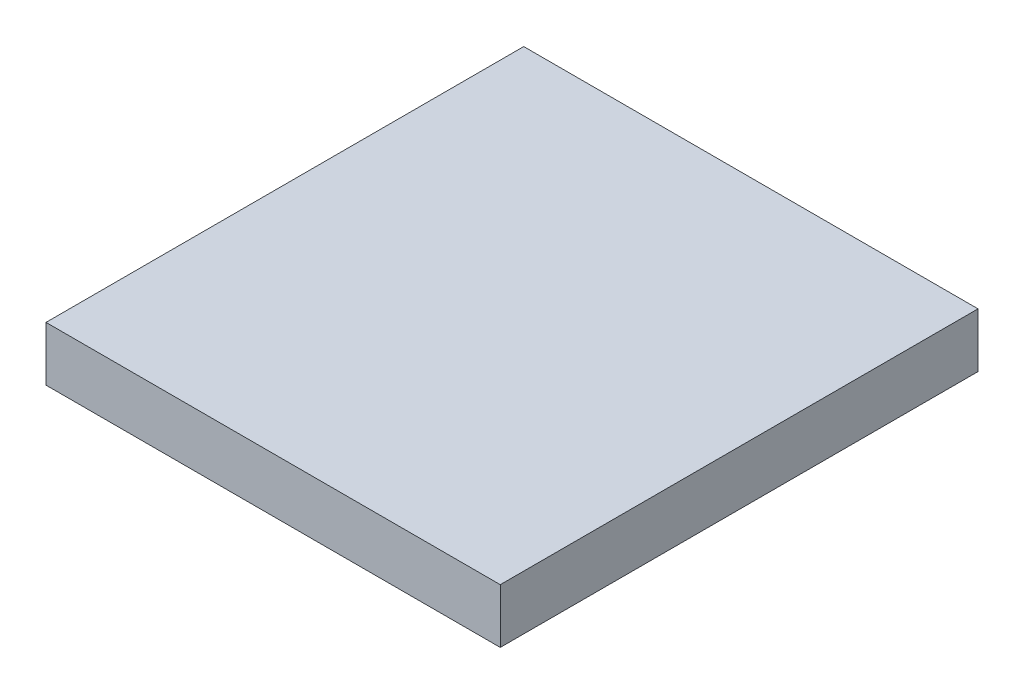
ISO-10303-21;
HEADER;
FILE_DESCRIPTION(('STEP AP214'),'2;1');
FILE_NAME('part.step','',(''),(''),'','','');
FILE_SCHEMA(('AUTOMOTIVE_DESIGN { 1 0 10303 214 1 1 1 1 }'));
ENDSEC;
DATA;
#1=APPLICATION_CONTEXT('core data for automotive mechanical design processes');
#2=APPLICATION_PROTOCOL_DEFINITION('international standard','automotive_design',2000,#1);
#3=PRODUCT_CONTEXT('',#1,'mechanical');
#4=PRODUCT('Part','Part','',(#3));
#5=PRODUCT_RELATED_PRODUCT_CATEGORY('part','',(#4));
#6=PRODUCT_DEFINITION_FORMATION('','',#4);
#7=PRODUCT_DEFINITION_CONTEXT('part definition',#1,'design');
#8=PRODUCT_DEFINITION('design','',#6,#7);
#9=PRODUCT_DEFINITION_SHAPE('','',#8);
#10=(LENGTH_UNIT() NAMED_UNIT(*) SI_UNIT(.MILLI.,.METRE.));
#11=(NAMED_UNIT(*) PLANE_ANGLE_UNIT() SI_UNIT($,.RADIAN.));
#12=(NAMED_UNIT(*) SI_UNIT($,.STERADIAN.) SOLID_ANGLE_UNIT());
#13=UNCERTAINTY_MEASURE_WITH_UNIT(LENGTH_MEASURE(1.E-05),#10,'distance_accuracy_value','');
#14=(GEOMETRIC_REPRESENTATION_CONTEXT(3) GLOBAL_UNCERTAINTY_ASSIGNED_CONTEXT((#13)) GLOBAL_UNIT_ASSIGNED_CONTEXT((#10,
#11,#12)) REPRESENTATION_CONTEXT('',''));
#15=CARTESIAN_POINT('',(0.,0.,0.));
#16=DIRECTION('',(0.,0.,1.));
#17=DIRECTION('',(1.,0.,0.));
#18=AXIS2_PLACEMENT_3D('',#15,#16,#17);
#19=CARTESIAN_POINT('',(0.,12.,0.));
#20=DIRECTION('',(1.,0.,0.));
#21=DIRECTION('',(0.,0.,-1.));
#22=AXIS2_PLACEMENT_3D('',#19,#20,#21);
#23=PLANE('',#22);
#24=DIRECTION('',(0.,0.,1.));
#25=VECTOR('',#24,1.);
#26=CARTESIAN_POINT('',(0.,0.,0.));
#27=LINE('',#26,#25);
#28=CARTESIAN_POINT('',(0.,0.,-105.436041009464));
#29=VERTEX_POINT('',#28);
#30=CARTESIAN_POINT('',(0.,0.,0.));
#31=VERTEX_POINT('',#30);
#32=EDGE_CURVE('E75',#29,#31,#27,.T.);
#33=ORIENTED_EDGE('',*,*,#32,.T.);
#34=DIRECTION('',(0.,-1.,0.));
#35=VECTOR('',#34,1.);
#36=CARTESIAN_POINT('',(0.,12.,0.));
#37=LINE('',#36,#35);
#38=CARTESIAN_POINT('',(0.,12.,0.));
#39=VERTEX_POINT('',#38);
#40=EDGE_CURVE('E11',#39,#31,#37,.T.);
#41=ORIENTED_EDGE('',*,*,#40,.F.);
#42=DIRECTION('',(0.,0.,1.));
#43=VECTOR('',#42,1.);
#44=CARTESIAN_POINT('',(0.,12.,0.));
#45=LINE('',#44,#43);
#46=CARTESIAN_POINT('',(0.,12.,-105.436041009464));
#47=VERTEX_POINT('',#46);
#48=EDGE_CURVE('E93',#47,#39,#45,.T.);
#49=ORIENTED_EDGE('',*,*,#48,.F.);
#50=DIRECTION('',(0.,-1.,0.));
#51=VECTOR('',#50,1.);
#52=CARTESIAN_POINT('',(0.,12.,-105.436041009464));
#53=LINE('',#52,#51);
#54=EDGE_CURVE('E87',#47,#29,#53,.T.);
#55=ORIENTED_EDGE('',*,*,#54,.T.);
#56=EDGE_LOOP('',(#33,#41,#49,#55));
#57=FACE_BOUND('',#56,.T.);
#58=ADVANCED_FACE('F31',(#57),#23,.F.);
#59=CARTESIAN_POINT('',(0.,12.,0.));
#60=DIRECTION('',(0.,0.,-1.));
#61=DIRECTION('',(-1.,0.,0.));
#62=AXIS2_PLACEMENT_3D('',#59,#60,#61);
#63=PLANE('',#62);
#64=DIRECTION('',(1.,0.,0.));
#65=VECTOR('',#64,1.);
#66=CARTESIAN_POINT('',(0.,0.,0.));
#67=LINE('',#66,#65);
#68=CARTESIAN_POINT('',(100.257886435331,0.,0.));
#69=VERTEX_POINT('',#68);
#70=EDGE_CURVE('E71',#31,#69,#67,.T.);
#71=ORIENTED_EDGE('',*,*,#70,.T.);
#72=DIRECTION('',(0.,-1.,0.));
#73=VECTOR('',#72,1.);
#74=CARTESIAN_POINT('',(100.257886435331,12.,0.));
#75=LINE('',#74,#73);
#76=CARTESIAN_POINT('',(100.257886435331,12.,0.));
#77=VERTEX_POINT('',#76);
#78=EDGE_CURVE('E38',#77,#69,#75,.T.);
#79=ORIENTED_EDGE('',*,*,#78,.F.);
#80=DIRECTION('',(1.,0.,0.));
#81=VECTOR('',#80,1.);
#82=CARTESIAN_POINT('',(0.,12.,0.));
#83=LINE('',#82,#81);
#84=EDGE_CURVE('E83',#39,#77,#83,.T.);
#85=ORIENTED_EDGE('',*,*,#84,.F.);
#86=ORIENTED_EDGE('',*,*,#40,.T.);
#87=EDGE_LOOP('',(#71,#79,#85,#86));
#88=FACE_BOUND('',#87,.T.);
#89=ADVANCED_FACE('F82',(#88),#63,.F.);
#90=CARTESIAN_POINT('',(100.257886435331,12.,0.));
#91=DIRECTION('',(-1.,0.,0.));
#92=DIRECTION('',(0.,0.,1.));
#93=AXIS2_PLACEMENT_3D('',#90,#91,#92);
#94=PLANE('',#93);
#95=DIRECTION('',(0.,0.,-1.));
#96=VECTOR('',#95,1.);
#97=CARTESIAN_POINT('',(100.257886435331,0.,0.));
#98=LINE('',#97,#96);
#99=CARTESIAN_POINT('',(100.257886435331,0.,-105.436041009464));
#100=VERTEX_POINT('',#99);
#101=EDGE_CURVE('E76',#69,#100,#98,.T.);
#102=ORIENTED_EDGE('',*,*,#101,.T.);
#103=DIRECTION('',(0.,-1.,0.));
#104=VECTOR('',#103,1.);
#105=CARTESIAN_POINT('',(100.257886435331,12.,-105.436041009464));
#106=LINE('',#105,#104);
#107=CARTESIAN_POINT('',(100.257886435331,12.,-105.436041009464));
#108=VERTEX_POINT('',#107);
#109=EDGE_CURVE('E99',#108,#100,#106,.T.);
#110=ORIENTED_EDGE('',*,*,#109,.F.);
#111=DIRECTION('',(0.,0.,-1.));
#112=VECTOR('',#111,1.);
#113=CARTESIAN_POINT('',(100.257886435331,12.,0.));
#114=LINE('',#113,#112);
#115=EDGE_CURVE('E50',#77,#108,#114,.T.);
#116=ORIENTED_EDGE('',*,*,#115,.F.);
#117=ORIENTED_EDGE('',*,*,#78,.T.);
#118=EDGE_LOOP('',(#102,#110,#116,#117));
#119=FACE_BOUND('',#118,.T.);
#120=ADVANCED_FACE('F102',(#119),#94,.F.);
#121=CARTESIAN_POINT('',(0.,12.,-105.436041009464));
#122=DIRECTION('',(0.,0.,1.));
#123=DIRECTION('',(1.,0.,0.));
#124=AXIS2_PLACEMENT_3D('',#121,#122,#123);
#125=PLANE('',#124);
#126=DIRECTION('',(-1.,0.,0.));
#127=VECTOR('',#126,1.);
#128=CARTESIAN_POINT('',(0.,0.,-105.436041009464));
#129=LINE('',#128,#127);
#130=EDGE_CURVE('E91',#100,#29,#129,.T.);
#131=ORIENTED_EDGE('',*,*,#130,.T.);
#132=ORIENTED_EDGE('',*,*,#54,.F.);
#133=DIRECTION('',(-1.,0.,0.));
#134=VECTOR('',#133,1.);
#135=CARTESIAN_POINT('',(0.,12.,-105.436041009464));
#136=LINE('',#135,#134);
#137=EDGE_CURVE('E45',#108,#47,#136,.T.);
#138=ORIENTED_EDGE('',*,*,#137,.F.);
#139=ORIENTED_EDGE('',*,*,#109,.T.);
#140=EDGE_LOOP('',(#131,#132,#138,#139));
#141=FACE_BOUND('',#140,.T.);
#142=ADVANCED_FACE('F104',(#141),#125,.F.);
#143=CARTESIAN_POINT('',(0.,12.,-105.436041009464));
#144=DIRECTION('',(0.,-1.,0.));
#145=DIRECTION('',(0.,0.,-1.));
#146=AXIS2_PLACEMENT_3D('',#143,#144,#145);
#147=PLANE('',#146);
#148=ORIENTED_EDGE('',*,*,#48,.T.);
#149=ORIENTED_EDGE('',*,*,#84,.T.);
#150=ORIENTED_EDGE('',*,*,#115,.T.);
#151=ORIENTED_EDGE('',*,*,#137,.T.);
#152=EDGE_LOOP('',(#148,#149,#150,#151));
#153=FACE_BOUND('',#152,.T.);
#154=ADVANCED_FACE('F105',(#153),#147,.F.);
#155=CARTESIAN_POINT('',(0.,0.,-105.436041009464));
#156=DIRECTION('',(0.,-1.,0.));
#157=DIRECTION('',(0.,0.,-1.));
#158=AXIS2_PLACEMENT_3D('',#155,#156,#157);
#159=PLANE('',#158);
#160=ORIENTED_EDGE('',*,*,#32,.F.);
#161=ORIENTED_EDGE('',*,*,#130,.F.);
#162=ORIENTED_EDGE('',*,*,#101,.F.);
#163=ORIENTED_EDGE('',*,*,#70,.F.);
#164=EDGE_LOOP('',(#160,#161,#162,#163));
#165=FACE_BOUND('',#164,.T.);
#166=ADVANCED_FACE('F72',(#165),#159,.T.);
#167=CLOSED_SHELL('',(#58,#89,#120,#142,#154,#166));
#168=MANIFOLD_SOLID_BREP('B2',#167);
#169=ADVANCED_BREP_SHAPE_REPRESENTATION('',(#18,#168),#14);
#170=SHAPE_DEFINITION_REPRESENTATION(#9,#169);
ENDSEC;
END-ISO-10303-21;
